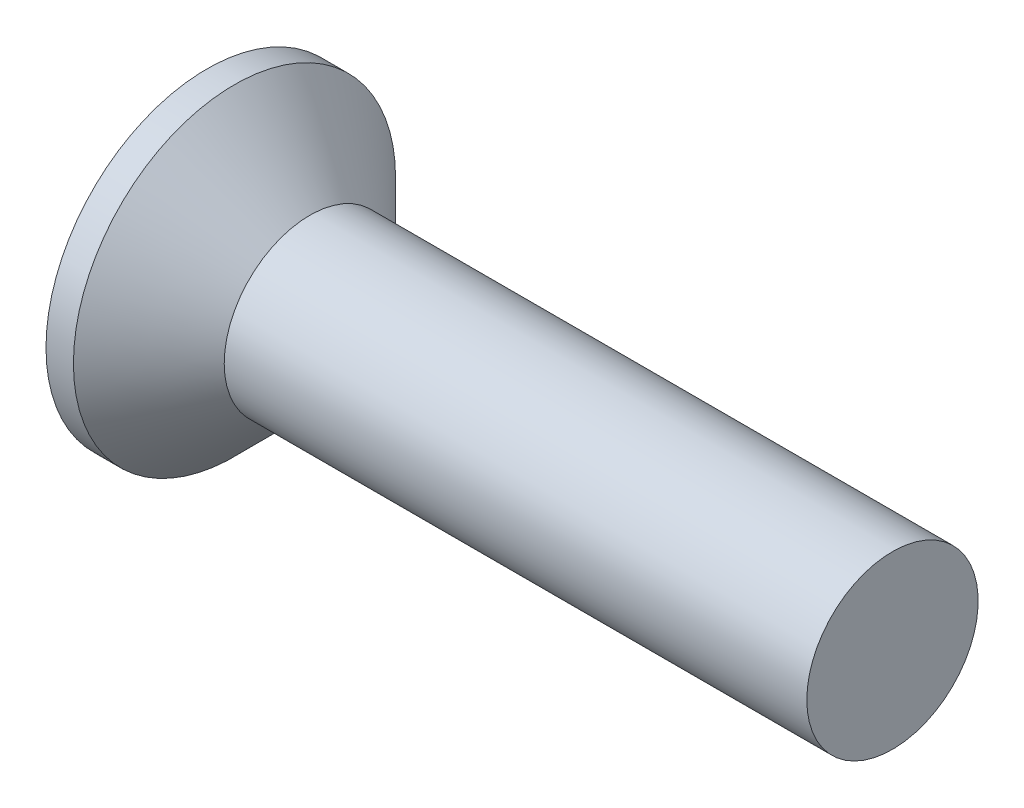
from build123d import *

# Parameters (mm, degrees)
CIRPATTERN1_COUNT = 2
CIRPATTERN1_ANGLE = 90


with BuildPart() as part:
    # BodySke → Base-Revolve (revolve)
    with BuildSketch(Plane.XY, mode=Mode.PRIVATE) as base_revolve_sk:
        Polygon((0, 0), (0, 2.35), (0.4, 2.35), (1.5, 1.25), (10, 1.25), (10, 0), align=None)
    revolve(base_revolve_sk.sketch.rotate(Axis((-6.35, 0, 0), (1, 0, 0)), 90), axis=Axis((-6.35, 0, 0), (1, 0, 0)))

    # Sketch3 → Cross section 0
    with BuildSketch(Plane.ZY):
        with BuildLine():
            Line((-0.37, 1.4), (0.37, 1.4))
            Line((0.37, 1.4), (0.37, -1.4))
            Line((0.37, -1.4), (-0.37, -1.4))
            Line((-0.37, -1.4), (-0.37, 1.4))
        make_face()
    # Sketch4 → Cross section 1
    with BuildSketch(Plane.ZY.offset(-1.78)):
        with BuildLine():
            Line((-0.185, 0.185), (0.185, 0.185))
            Line((0.185, 0.185), (0.185, -0.185))
            Line((0.185, -0.185), (-0.185, -0.185))
            Line((-0.185, -0.185), (-0.185, 0.185))
        make_face()
    cross = loft(mode=Mode.SUBTRACT)

    # CirPattern1: Cross ×2 about axis
    cirpattern1_axis = Axis((0, 0, 0), (1, 0, 0))
    for i in range(1, CIRPATTERN1_COUNT):
        add(cross.rotate(cirpattern1_axis, i * CIRPATTERN1_ANGLE / (CIRPATTERN1_COUNT - 1)), mode=Mode.SUBTRACT)


solid = part.part
